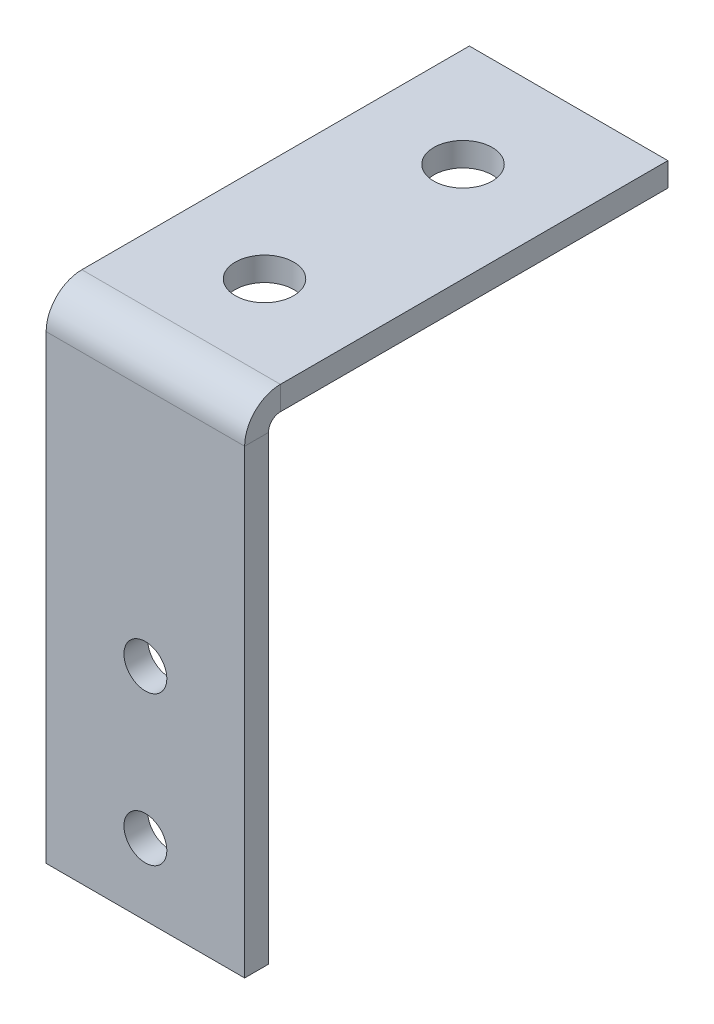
ISO-10303-21;
HEADER;
FILE_DESCRIPTION(('STEP AP214'),'2;1');
FILE_NAME('part.step','',(''),(''),'','','');
FILE_SCHEMA(('AUTOMOTIVE_DESIGN { 1 0 10303 214 1 1 1 1 }'));
ENDSEC;
DATA;
#1=APPLICATION_CONTEXT('core data for automotive mechanical design processes');
#2=APPLICATION_PROTOCOL_DEFINITION('international standard','automotive_design',2000,#1);
#3=PRODUCT_CONTEXT('',#1,'mechanical');
#4=PRODUCT('Part','Part','',(#3));
#5=PRODUCT_RELATED_PRODUCT_CATEGORY('part','',(#4));
#6=PRODUCT_DEFINITION_FORMATION('','',#4);
#7=PRODUCT_DEFINITION_CONTEXT('part definition',#1,'design');
#8=PRODUCT_DEFINITION('design','',#6,#7);
#9=PRODUCT_DEFINITION_SHAPE('','',#8);
#10=(LENGTH_UNIT() NAMED_UNIT(*) SI_UNIT(.MILLI.,.METRE.));
#11=(NAMED_UNIT(*) PLANE_ANGLE_UNIT() SI_UNIT($,.RADIAN.));
#12=(NAMED_UNIT(*) SI_UNIT($,.STERADIAN.) SOLID_ANGLE_UNIT());
#13=UNCERTAINTY_MEASURE_WITH_UNIT(LENGTH_MEASURE(1.E-05),#10,'distance_accuracy_value','');
#14=(GEOMETRIC_REPRESENTATION_CONTEXT(3) GLOBAL_UNCERTAINTY_ASSIGNED_CONTEXT((#13)) GLOBAL_UNIT_ASSIGNED_CONTEXT((#10,
#11,#12)) REPRESENTATION_CONTEXT('',''));
#15=CARTESIAN_POINT('',(0.,0.,0.));
#16=DIRECTION('',(0.,0.,1.));
#17=DIRECTION('',(1.,0.,0.));
#18=AXIS2_PLACEMENT_3D('',#15,#16,#17);
#19=CARTESIAN_POINT('',(6.35,0.,-2.286));
#20=DIRECTION('',(1.,0.,0.));
#21=DIRECTION('',(0.,0.,-1.));
#22=AXIS2_PLACEMENT_3D('',#19,#20,#21);
#23=PLANE('',#22);
#24=DIRECTION('',(0.,-1.,0.));
#25=VECTOR('',#24,1.);
#26=CARTESIAN_POINT('',(6.35,0.,-2.286));
#27=LINE('',#26,#25);
#28=CARTESIAN_POINT('',(6.35,0.,-2.286));
#29=VERTEX_POINT('',#28);
#30=CARTESIAN_POINT('',(6.35,-1.524,-2.286));
#31=VERTEX_POINT('',#30);
#32=EDGE_CURVE('E11',#29,#31,#27,.T.);
#33=ORIENTED_EDGE('',*,*,#32,.F.);
#34=CARTESIAN_POINT('',(6.35,-2.286,-2.286));
#35=DIRECTION('',(1.,0.,0.));
#36=DIRECTION('',(0.,0.,-1.));
#37=AXIS2_PLACEMENT_3D('',#34,#35,#36);
#38=CIRCLE('',#37,2.286);
#39=CARTESIAN_POINT('',(6.35,-2.286,0.));
#40=VERTEX_POINT('',#39);
#41=EDGE_CURVE('E136',#40,#29,#38,.F.);
#42=ORIENTED_EDGE('',*,*,#41,.F.);
#43=DIRECTION('',(0.,0.,1.));
#44=VECTOR('',#43,1.);
#45=CARTESIAN_POINT('',(6.35,-2.286,-1.524));
#46=LINE('',#45,#44);
#47=CARTESIAN_POINT('',(6.35,-2.286,-1.524));
#48=VERTEX_POINT('',#47);
#49=EDGE_CURVE('E46',#48,#40,#46,.T.);
#50=ORIENTED_EDGE('',*,*,#49,.F.);
#51=CARTESIAN_POINT('',(6.35,-2.286,-2.286));
#52=DIRECTION('',(1.,0.,0.));
#53=DIRECTION('',(0.,0.,-1.));
#54=AXIS2_PLACEMENT_3D('',#51,#52,#53);
#55=CIRCLE('',#54,0.762);
#56=EDGE_CURVE('E129',#48,#31,#55,.F.);
#57=ORIENTED_EDGE('',*,*,#56,.T.);
#58=EDGE_LOOP('',(#33,#42,#50,#57));
#59=FACE_BOUND('',#58,.T.);
#60=ADVANCED_FACE('F37',(#59),#23,.T.);
#61=CARTESIAN_POINT('',(6.35,-2.286,-1.524));
#62=DIRECTION('',(1.,0.,0.));
#63=DIRECTION('',(0.,0.,-1.));
#64=AXIS2_PLACEMENT_3D('',#61,#62,#63);
#65=PLANE('',#64);
#66=DIRECTION('',(0.,0.,-1.));
#67=VECTOR('',#66,1.);
#68=CARTESIAN_POINT('',(6.35,0.,0.));
#69=LINE('',#68,#67);
#70=CARTESIAN_POINT('',(6.35,0.,-27.0764));
#71=VERTEX_POINT('',#70);
#72=EDGE_CURVE('E194',#29,#71,#69,.T.);
#73=ORIENTED_EDGE('',*,*,#72,.F.);
#74=ORIENTED_EDGE('',*,*,#32,.T.);
#75=DIRECTION('',(0.,0.,-1.));
#76=VECTOR('',#75,1.);
#77=CARTESIAN_POINT('',(6.35,-1.524,0.));
#78=LINE('',#77,#76);
#79=CARTESIAN_POINT('',(6.35,-1.524,-27.0764));
#80=VERTEX_POINT('',#79);
#81=EDGE_CURVE('E95',#31,#80,#78,.T.);
#82=ORIENTED_EDGE('',*,*,#81,.T.);
#83=DIRECTION('',(0.,-1.,0.));
#84=VECTOR('',#83,1.);
#85=CARTESIAN_POINT('',(6.35,0.,-27.0764));
#86=LINE('',#85,#84);
#87=EDGE_CURVE('E191',#71,#80,#86,.T.);
#88=ORIENTED_EDGE('',*,*,#87,.F.);
#89=EDGE_LOOP('',(#73,#74,#82,#88));
#90=FACE_BOUND('',#89,.T.);
#91=ADVANCED_FACE('F214',(#90),#65,.T.);
#92=CARTESIAN_POINT('',(-6.35,-2.286,0.));
#93=DIRECTION('',(-1.,0.,0.));
#94=DIRECTION('',(0.,0.,1.));
#95=AXIS2_PLACEMENT_3D('',#92,#93,#94);
#96=PLANE('',#95);
#97=DIRECTION('',(0.,0.,-1.));
#98=VECTOR('',#97,1.);
#99=CARTESIAN_POINT('',(-6.35,-2.286,0.));
#100=LINE('',#99,#98);
#101=CARTESIAN_POINT('',(-6.35,-2.286,0.));
#102=VERTEX_POINT('',#101);
#103=CARTESIAN_POINT('',(-6.35,-2.286,-1.524));
#104=VERTEX_POINT('',#103);
#105=EDGE_CURVE('E82',#102,#104,#100,.T.);
#106=ORIENTED_EDGE('',*,*,#105,.F.);
#107=CARTESIAN_POINT('',(-6.35,-2.286,-2.286));
#108=DIRECTION('',(1.,0.,0.));
#109=DIRECTION('',(0.,0.,-1.));
#110=AXIS2_PLACEMENT_3D('',#107,#108,#109);
#111=CIRCLE('',#110,2.286);
#112=CARTESIAN_POINT('',(-6.35,0.,-2.286));
#113=VERTEX_POINT('',#112);
#114=EDGE_CURVE('E152',#102,#113,#111,.F.);
#115=ORIENTED_EDGE('',*,*,#114,.T.);
#116=DIRECTION('',(0.,1.,0.));
#117=VECTOR('',#116,1.);
#118=CARTESIAN_POINT('',(-6.35,-1.524,-2.286));
#119=LINE('',#118,#117);
#120=CARTESIAN_POINT('',(-6.35,-1.524,-2.286));
#121=VERTEX_POINT('',#120);
#122=EDGE_CURVE('E89',#121,#113,#119,.T.);
#123=ORIENTED_EDGE('',*,*,#122,.F.);
#124=CARTESIAN_POINT('',(-6.35,-2.286,-2.286));
#125=DIRECTION('',(1.,0.,0.));
#126=DIRECTION('',(0.,0.,-1.));
#127=AXIS2_PLACEMENT_3D('',#124,#125,#126);
#128=CIRCLE('',#127,0.762);
#129=EDGE_CURVE('E159',#104,#121,#128,.F.);
#130=ORIENTED_EDGE('',*,*,#129,.F.);
#131=EDGE_LOOP('',(#106,#115,#123,#130));
#132=FACE_BOUND('',#131,.T.);
#133=ADVANCED_FACE('F212',(#132),#96,.T.);
#134=CARTESIAN_POINT('',(-6.35,-1.524,-2.286));
#135=DIRECTION('',(-1.,0.,0.));
#136=DIRECTION('',(0.,0.,1.));
#137=AXIS2_PLACEMENT_3D('',#134,#135,#136);
#138=PLANE('',#137);
#139=DIRECTION('',(0.,1.,0.));
#140=VECTOR('',#139,1.);
#141=CARTESIAN_POINT('',(-6.35,0.,0.));
#142=LINE('',#141,#140);
#143=CARTESIAN_POINT('',(-6.35,-31.75,0.));
#144=VERTEX_POINT('',#143);
#145=EDGE_CURVE('E154',#144,#102,#142,.T.);
#146=ORIENTED_EDGE('',*,*,#145,.T.);
#147=ORIENTED_EDGE('',*,*,#105,.T.);
#148=DIRECTION('',(0.,1.,0.));
#149=VECTOR('',#148,1.);
#150=CARTESIAN_POINT('',(-6.35,0.,-1.524));
#151=LINE('',#150,#149);
#152=CARTESIAN_POINT('',(-6.35,-31.75,-1.524));
#153=VERTEX_POINT('',#152);
#154=EDGE_CURVE('E157',#153,#104,#151,.T.);
#155=ORIENTED_EDGE('',*,*,#154,.F.);
#156=DIRECTION('',(0.,0.,1.));
#157=VECTOR('',#156,1.);
#158=CARTESIAN_POINT('',(-6.35,-31.75,-1.524));
#159=LINE('',#158,#157);
#160=EDGE_CURVE('E117',#153,#144,#159,.T.);
#161=ORIENTED_EDGE('',*,*,#160,.T.);
#162=EDGE_LOOP('',(#146,#147,#155,#161));
#163=FACE_BOUND('',#162,.T.);
#164=ADVANCED_FACE('F208',(#163),#138,.T.);
#165=CARTESIAN_POINT('',(6.35,-1.524,0.));
#166=DIRECTION('',(0.,1.,0.));
#167=DIRECTION('',(0.,0.,1.));
#168=AXIS2_PLACEMENT_3D('',#165,#166,#167);
#169=PLANE('',#168);
#170=CARTESIAN_POINT('',(0.,-1.524,-20.32));
#171=DIRECTION('',(0.,1.,0.));
#172=DIRECTION('',(0.,0.,1.));
#173=AXIS2_PLACEMENT_3D('',#170,#171,#172);
#174=CIRCLE('',#173,1.8669);
#175=CARTESIAN_POINT('',(0.,-1.524,-18.4531));
#176=VERTEX_POINT('',#175);
#177=EDGE_CURVE('E415',#176,#176,#174,.T.);
#178=ORIENTED_EDGE('',*,*,#177,.T.);
#179=EDGE_LOOP('',(#178));
#180=FACE_BOUND('',#179,.T.);
#181=CARTESIAN_POINT('',(0.,-1.524,-7.62));
#182=DIRECTION('',(0.,1.,0.));
#183=DIRECTION('',(0.,0.,1.));
#184=AXIS2_PLACEMENT_3D('',#181,#182,#183);
#185=CIRCLE('',#184,1.8669);
#186=CARTESIAN_POINT('',(0.,-1.524,-5.7531));
#187=VERTEX_POINT('',#186);
#188=EDGE_CURVE('E419',#187,#187,#185,.T.);
#189=ORIENTED_EDGE('',*,*,#188,.T.);
#190=EDGE_LOOP('',(#189));
#191=FACE_BOUND('',#190,.T.);
#192=DIRECTION('',(0.,0.,-1.));
#193=VECTOR('',#192,1.);
#194=CARTESIAN_POINT('',(-6.35,-1.524,0.));
#195=LINE('',#194,#193);
#196=CARTESIAN_POINT('',(-6.35,-1.524,-27.0764));
#197=VERTEX_POINT('',#196);
#198=EDGE_CURVE('E142',#121,#197,#195,.T.);
#199=ORIENTED_EDGE('',*,*,#198,.T.);
#200=DIRECTION('',(-1.,0.,0.));
#201=VECTOR('',#200,1.);
#202=CARTESIAN_POINT('',(6.35,-1.524,-27.0764));
#203=LINE('',#202,#201);
#204=EDGE_CURVE('E173',#80,#197,#203,.T.);
#205=ORIENTED_EDGE('',*,*,#204,.F.);
#206=ORIENTED_EDGE('',*,*,#81,.F.);
#207=DIRECTION('',(-1.,0.,0.));
#208=VECTOR('',#207,1.);
#209=CARTESIAN_POINT('',(6.35,-1.524,-2.286));
#210=LINE('',#209,#208);
#211=EDGE_CURVE('E141',#31,#121,#210,.T.);
#212=ORIENTED_EDGE('',*,*,#211,.T.);
#213=EDGE_LOOP('',(#199,#205,#206,#212));
#214=FACE_BOUND('',#213,.T.);
#215=ADVANCED_FACE('F220',(#180,#191,#214),#169,.F.);
#216=CARTESIAN_POINT('',(6.35,0.,-27.0764));
#217=DIRECTION('',(0.,0.,-1.));
#218=DIRECTION('',(0.,1.,0.));
#219=AXIS2_PLACEMENT_3D('',#216,#217,#218);
#220=PLANE('',#219);
#221=DIRECTION('',(0.,-1.,0.));
#222=VECTOR('',#221,1.);
#223=CARTESIAN_POINT('',(-6.35,0.,-27.0764));
#224=LINE('',#223,#222);
#225=CARTESIAN_POINT('',(-6.35,0.,-27.0764));
#226=VERTEX_POINT('',#225);
#227=EDGE_CURVE('E145',#226,#197,#224,.T.);
#228=ORIENTED_EDGE('',*,*,#227,.F.);
#229=DIRECTION('',(-1.,0.,0.));
#230=VECTOR('',#229,1.);
#231=CARTESIAN_POINT('',(6.35,0.,-27.0764));
#232=LINE('',#231,#230);
#233=EDGE_CURVE('E171',#71,#226,#232,.T.);
#234=ORIENTED_EDGE('',*,*,#233,.F.);
#235=ORIENTED_EDGE('',*,*,#87,.T.);
#236=ORIENTED_EDGE('',*,*,#204,.T.);
#237=EDGE_LOOP('',(#228,#234,#235,#236));
#238=FACE_BOUND('',#237,.T.);
#239=ADVANCED_FACE('F249',(#238),#220,.T.);
#240=CARTESIAN_POINT('',(6.35,0.,0.));
#241=DIRECTION('',(0.,1.,0.));
#242=DIRECTION('',(0.,0.,1.));
#243=AXIS2_PLACEMENT_3D('',#240,#241,#242);
#244=PLANE('',#243);
#245=CARTESIAN_POINT('',(0.,0.,-20.32));
#246=DIRECTION('',(0.,1.,0.));
#247=DIRECTION('',(0.,0.,1.));
#248=AXIS2_PLACEMENT_3D('',#245,#246,#247);
#249=CIRCLE('',#248,1.8669);
#250=CARTESIAN_POINT('',(0.,0.,-18.4531));
#251=VERTEX_POINT('',#250);
#252=EDGE_CURVE('E412',#251,#251,#249,.T.);
#253=ORIENTED_EDGE('',*,*,#252,.F.);
#254=EDGE_LOOP('',(#253));
#255=FACE_BOUND('',#254,.T.);
#256=CARTESIAN_POINT('',(0.,0.,-7.62));
#257=DIRECTION('',(0.,1.,0.));
#258=DIRECTION('',(0.,0.,1.));
#259=AXIS2_PLACEMENT_3D('',#256,#257,#258);
#260=CIRCLE('',#259,1.8669);
#261=CARTESIAN_POINT('',(0.,0.,-5.7531));
#262=VERTEX_POINT('',#261);
#263=EDGE_CURVE('E416',#262,#262,#260,.T.);
#264=ORIENTED_EDGE('',*,*,#263,.F.);
#265=EDGE_LOOP('',(#264));
#266=FACE_BOUND('',#265,.T.);
#267=DIRECTION('',(0.,0.,-1.));
#268=VECTOR('',#267,1.);
#269=CARTESIAN_POINT('',(-6.35,0.,0.));
#270=LINE('',#269,#268);
#271=EDGE_CURVE('E149',#113,#226,#270,.T.);
#272=ORIENTED_EDGE('',*,*,#271,.F.);
#273=DIRECTION('',(-1.,0.,0.));
#274=VECTOR('',#273,1.);
#275=CARTESIAN_POINT('',(6.35,0.,-2.286));
#276=LINE('',#275,#274);
#277=EDGE_CURVE('E168',#29,#113,#276,.T.);
#278=ORIENTED_EDGE('',*,*,#277,.F.);
#279=ORIENTED_EDGE('',*,*,#72,.T.);
#280=ORIENTED_EDGE('',*,*,#233,.T.);
#281=EDGE_LOOP('',(#272,#278,#279,#280));
#282=FACE_BOUND('',#281,.T.);
#283=ADVANCED_FACE('F254',(#255,#266,#282),#244,.T.);
#284=CARTESIAN_POINT('',(6.35,-2.286,-2.286));
#285=DIRECTION('',(-1.,0.,0.));
#286=DIRECTION('',(0.,0.,1.));
#287=AXIS2_PLACEMENT_3D('',#284,#285,#286);
#288=CYLINDRICAL_SURFACE('',#287,2.286);
#289=ORIENTED_EDGE('',*,*,#114,.F.);
#290=DIRECTION('',(-1.,0.,0.));
#291=VECTOR('',#290,1.);
#292=CARTESIAN_POINT('',(6.35,-2.286,0.));
#293=LINE('',#292,#291);
#294=EDGE_CURVE('E165',#40,#102,#293,.T.);
#295=ORIENTED_EDGE('',*,*,#294,.F.);
#296=ORIENTED_EDGE('',*,*,#41,.T.);
#297=ORIENTED_EDGE('',*,*,#277,.T.);
#298=EDGE_LOOP('',(#289,#295,#296,#297));
#299=FACE_BOUND('',#298,.T.);
#300=ADVANCED_FACE('F201',(#299),#288,.T.);
#301=CARTESIAN_POINT('',(6.35,0.,0.));
#302=DIRECTION('',(0.,0.,1.));
#303=DIRECTION('',(0.,-1.,0.));
#304=AXIS2_PLACEMENT_3D('',#301,#302,#303);
#305=PLANE('',#304);
#306=CARTESIAN_POINT('',(0.,-17.653,0.));
#307=DIRECTION('',(0.,0.,1.));
#308=DIRECTION('',(1.,0.,0.));
#309=AXIS2_PLACEMENT_3D('',#306,#307,#308);
#310=CIRCLE('',#309,1.3716);
#311=CARTESIAN_POINT('',(1.3716,-17.653,0.));
#312=VERTEX_POINT('',#311);
#313=EDGE_CURVE('E186',#312,#312,#310,.T.);
#314=ORIENTED_EDGE('',*,*,#313,.F.);
#315=EDGE_LOOP('',(#314));
#316=FACE_BOUND('',#315,.T.);
#317=CARTESIAN_POINT('',(0.,-27.178,0.));
#318=DIRECTION('',(0.,0.,1.));
#319=DIRECTION('',(1.,0.,0.));
#320=AXIS2_PLACEMENT_3D('',#317,#318,#319);
#321=CIRCLE('',#320,1.3716);
#322=CARTESIAN_POINT('',(1.3716,-27.178,0.));
#323=VERTEX_POINT('',#322);
#324=EDGE_CURVE('E178',#323,#323,#321,.T.);
#325=ORIENTED_EDGE('',*,*,#324,.F.);
#326=EDGE_LOOP('',(#325));
#327=FACE_BOUND('',#326,.T.);
#328=ORIENTED_EDGE('',*,*,#145,.F.);
#329=DIRECTION('',(-1.,0.,0.));
#330=VECTOR('',#329,1.);
#331=CARTESIAN_POINT('',(6.35,-31.75,0.));
#332=LINE('',#331,#330);
#333=CARTESIAN_POINT('',(6.35,-31.75,0.));
#334=VERTEX_POINT('',#333);
#335=EDGE_CURVE('E119',#334,#144,#332,.T.);
#336=ORIENTED_EDGE('',*,*,#335,.F.);
#337=DIRECTION('',(0.,1.,0.));
#338=VECTOR('',#337,1.);
#339=CARTESIAN_POINT('',(6.35,0.,0.));
#340=LINE('',#339,#338);
#341=EDGE_CURVE('E134',#334,#40,#340,.T.);
#342=ORIENTED_EDGE('',*,*,#341,.T.);
#343=ORIENTED_EDGE('',*,*,#294,.T.);
#344=EDGE_LOOP('',(#328,#336,#342,#343));
#345=FACE_BOUND('',#344,.T.);
#346=ADVANCED_FACE('F207',(#316,#327,#345),#305,.T.);
#347=CARTESIAN_POINT('',(6.35,-31.75,-1.524));
#348=DIRECTION('',(0.,-1.,0.));
#349=DIRECTION('',(0.,0.,-1.));
#350=AXIS2_PLACEMENT_3D('',#347,#348,#349);
#351=PLANE('',#350);
#352=ORIENTED_EDGE('',*,*,#160,.F.);
#353=DIRECTION('',(-1.,0.,0.));
#354=VECTOR('',#353,1.);
#355=CARTESIAN_POINT('',(6.35,-31.75,-1.524));
#356=LINE('',#355,#354);
#357=CARTESIAN_POINT('',(6.35,-31.75,-1.524));
#358=VERTEX_POINT('',#357);
#359=EDGE_CURVE('E111',#358,#153,#356,.T.);
#360=ORIENTED_EDGE('',*,*,#359,.F.);
#361=DIRECTION('',(0.,0.,1.));
#362=VECTOR('',#361,1.);
#363=CARTESIAN_POINT('',(6.35,-31.75,-1.524));
#364=LINE('',#363,#362);
#365=EDGE_CURVE('E115',#358,#334,#364,.T.);
#366=ORIENTED_EDGE('',*,*,#365,.T.);
#367=ORIENTED_EDGE('',*,*,#335,.T.);
#368=EDGE_LOOP('',(#352,#360,#366,#367));
#369=FACE_BOUND('',#368,.T.);
#370=ADVANCED_FACE('F113',(#369),#351,.T.);
#371=CARTESIAN_POINT('',(6.35,0.,-1.524));
#372=DIRECTION('',(0.,0.,1.));
#373=DIRECTION('',(0.,-1.,0.));
#374=AXIS2_PLACEMENT_3D('',#371,#372,#373);
#375=PLANE('',#374);
#376=CARTESIAN_POINT('',(0.,-17.653,-1.524));
#377=DIRECTION('',(0.,0.,1.));
#378=DIRECTION('',(0.,-1.,0.));
#379=AXIS2_PLACEMENT_3D('',#376,#377,#378);
#380=CIRCLE('',#379,1.3716);
#381=CARTESIAN_POINT('',(0.,-19.0246,-1.524));
#382=VERTEX_POINT('',#381);
#383=EDGE_CURVE('E40',#382,#382,#380,.T.);
#384=ORIENTED_EDGE('',*,*,#383,.T.);
#385=EDGE_LOOP('',(#384));
#386=FACE_BOUND('',#385,.T.);
#387=CARTESIAN_POINT('',(0.,-27.178,-1.524));
#388=DIRECTION('',(0.,0.,1.));
#389=DIRECTION('',(0.,-1.,0.));
#390=AXIS2_PLACEMENT_3D('',#387,#388,#389);
#391=CIRCLE('',#390,1.3716);
#392=CARTESIAN_POINT('',(0.,-28.5496,-1.524));
#393=VERTEX_POINT('',#392);
#394=EDGE_CURVE('E146',#393,#393,#391,.T.);
#395=ORIENTED_EDGE('',*,*,#394,.T.);
#396=EDGE_LOOP('',(#395));
#397=FACE_BOUND('',#396,.T.);
#398=ORIENTED_EDGE('',*,*,#154,.T.);
#399=DIRECTION('',(-1.,0.,0.));
#400=VECTOR('',#399,1.);
#401=CARTESIAN_POINT('',(6.35,-2.286,-1.524));
#402=LINE('',#401,#400);
#403=EDGE_CURVE('E120',#48,#104,#402,.T.);
#404=ORIENTED_EDGE('',*,*,#403,.F.);
#405=DIRECTION('',(0.,1.,0.));
#406=VECTOR('',#405,1.);
#407=CARTESIAN_POINT('',(6.35,0.,-1.524));
#408=LINE('',#407,#406);
#409=EDGE_CURVE('E124',#358,#48,#408,.T.);
#410=ORIENTED_EDGE('',*,*,#409,.F.);
#411=ORIENTED_EDGE('',*,*,#359,.T.);
#412=EDGE_LOOP('',(#398,#404,#410,#411));
#413=FACE_BOUND('',#412,.T.);
#414=ADVANCED_FACE('F125',(#386,#397,#413),#375,.F.);
#415=CARTESIAN_POINT('',(6.35,-2.286,-2.286));
#416=DIRECTION('',(-1.,0.,0.));
#417=DIRECTION('',(0.,0.,1.));
#418=AXIS2_PLACEMENT_3D('',#415,#416,#417);
#419=CYLINDRICAL_SURFACE('',#418,0.762);
#420=ORIENTED_EDGE('',*,*,#129,.T.);
#421=ORIENTED_EDGE('',*,*,#211,.F.);
#422=ORIENTED_EDGE('',*,*,#56,.F.);
#423=ORIENTED_EDGE('',*,*,#403,.T.);
#424=EDGE_LOOP('',(#420,#421,#422,#423));
#425=FACE_BOUND('',#424,.T.);
#426=ADVANCED_FACE('F210',(#425),#419,.F.);
#427=CARTESIAN_POINT('',(6.35,-2.286,-2.286));
#428=DIRECTION('',(1.,0.,0.));
#429=DIRECTION('',(0.,0.,-1.));
#430=AXIS2_PLACEMENT_3D('',#427,#428,#429);
#431=PLANE('',#430);
#432=ORIENTED_EDGE('',*,*,#409,.T.);
#433=ORIENTED_EDGE('',*,*,#49,.T.);
#434=ORIENTED_EDGE('',*,*,#341,.F.);
#435=ORIENTED_EDGE('',*,*,#365,.F.);
#436=EDGE_LOOP('',(#432,#433,#434,#435));
#437=FACE_BOUND('',#436,.T.);
#438=ADVANCED_FACE('F132',(#437),#431,.T.);
#439=CARTESIAN_POINT('',(-6.35,-2.286,-2.286));
#440=DIRECTION('',(1.,0.,0.));
#441=DIRECTION('',(0.,0.,-1.));
#442=AXIS2_PLACEMENT_3D('',#439,#440,#441);
#443=PLANE('',#442);
#444=ORIENTED_EDGE('',*,*,#198,.F.);
#445=ORIENTED_EDGE('',*,*,#122,.T.);
#446=ORIENTED_EDGE('',*,*,#271,.T.);
#447=ORIENTED_EDGE('',*,*,#227,.T.);
#448=EDGE_LOOP('',(#444,#445,#446,#447));
#449=FACE_BOUND('',#448,.T.);
#450=ADVANCED_FACE('F298',(#449),#443,.F.);
#451=CARTESIAN_POINT('',(0.,-27.178,-27.0764));
#452=DIRECTION('',(0.,0.,1.));
#453=DIRECTION('',(1.,0.,0.));
#454=AXIS2_PLACEMENT_3D('',#451,#452,#453);
#455=CYLINDRICAL_SURFACE('',#454,1.3716);
#456=ORIENTED_EDGE('',*,*,#324,.T.);
#457=EDGE_LOOP('',(#456));
#458=FACE_BOUND('',#457,.T.);
#459=ORIENTED_EDGE('',*,*,#394,.F.);
#460=EDGE_LOOP('',(#459));
#461=FACE_BOUND('',#460,.T.);
#462=ADVANCED_FACE('F308',(#458,#461),#455,.F.);
#463=CARTESIAN_POINT('',(0.,-17.653,-27.0764));
#464=DIRECTION('',(0.,0.,1.));
#465=DIRECTION('',(1.,0.,0.));
#466=AXIS2_PLACEMENT_3D('',#463,#464,#465);
#467=CYLINDRICAL_SURFACE('',#466,1.3716);
#468=ORIENTED_EDGE('',*,*,#313,.T.);
#469=EDGE_LOOP('',(#468));
#470=FACE_BOUND('',#469,.T.);
#471=ORIENTED_EDGE('',*,*,#383,.F.);
#472=EDGE_LOOP('',(#471));
#473=FACE_BOUND('',#472,.T.);
#474=ADVANCED_FACE('F335',(#470,#473),#467,.F.);
#475=CARTESIAN_POINT('',(0.,-31.75,-7.62));
#476=DIRECTION('',(0.,1.,0.));
#477=DIRECTION('',(0.,0.,1.));
#478=AXIS2_PLACEMENT_3D('',#475,#476,#477);
#479=CYLINDRICAL_SURFACE('',#478,1.8669);
#480=ORIENTED_EDGE('',*,*,#263,.T.);
#481=EDGE_LOOP('',(#480));
#482=FACE_BOUND('',#481,.T.);
#483=ORIENTED_EDGE('',*,*,#188,.F.);
#484=EDGE_LOOP('',(#483));
#485=FACE_BOUND('',#484,.T.);
#486=ADVANCED_FACE('F345',(#482,#485),#479,.F.);
#487=CARTESIAN_POINT('',(0.,-31.75,-20.32));
#488=DIRECTION('',(0.,1.,0.));
#489=DIRECTION('',(0.,0.,1.));
#490=AXIS2_PLACEMENT_3D('',#487,#488,#489);
#491=CYLINDRICAL_SURFACE('',#490,1.8669);
#492=ORIENTED_EDGE('',*,*,#252,.T.);
#493=EDGE_LOOP('',(#492));
#494=FACE_BOUND('',#493,.T.);
#495=ORIENTED_EDGE('',*,*,#177,.F.);
#496=EDGE_LOOP('',(#495));
#497=FACE_BOUND('',#496,.T.);
#498=ADVANCED_FACE('F372',(#494,#497),#491,.F.);
#499=CLOSED_SHELL('',(#60,#91,#133,#164,#215,#239,#283,#300,#346,#370,#414,#426,#438,#450,#462,
#474,#486,#498));
#500=MANIFOLD_SOLID_BREP('B2',#499);
#501=ADVANCED_BREP_SHAPE_REPRESENTATION('',(#18,#500),#14);
#502=SHAPE_DEFINITION_REPRESENTATION(#9,#501);
ENDSEC;
END-ISO-10303-21;
